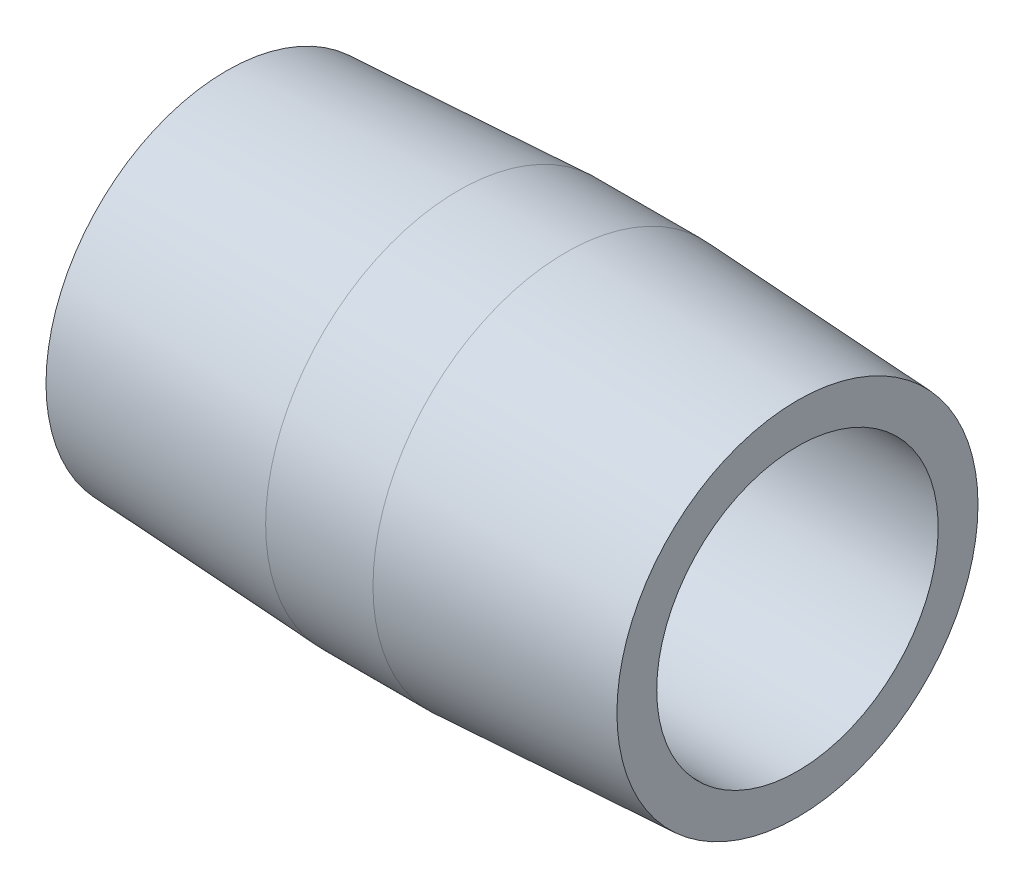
from build123d import *


with BuildPart() as part:
    # Sketch1 → Revolve1 (revolve)
    with BuildSketch(Plane.XY, mode=Mode.PRIVATE) as revolve1_sk:
        Polygon((25.4, 6.2611), (0, 6.2611), (0, 8.032050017), (10.3124, 8.5725), (15.0876, 8.5725), (25.4, 8.032050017), align=None)
    revolve(revolve1_sk.sketch.rotate(Axis((0, 0, 0), (1, 0, 0)), 90), axis=Axis((0, 0, 0), (1, 0, 0)))


solid = part.part
